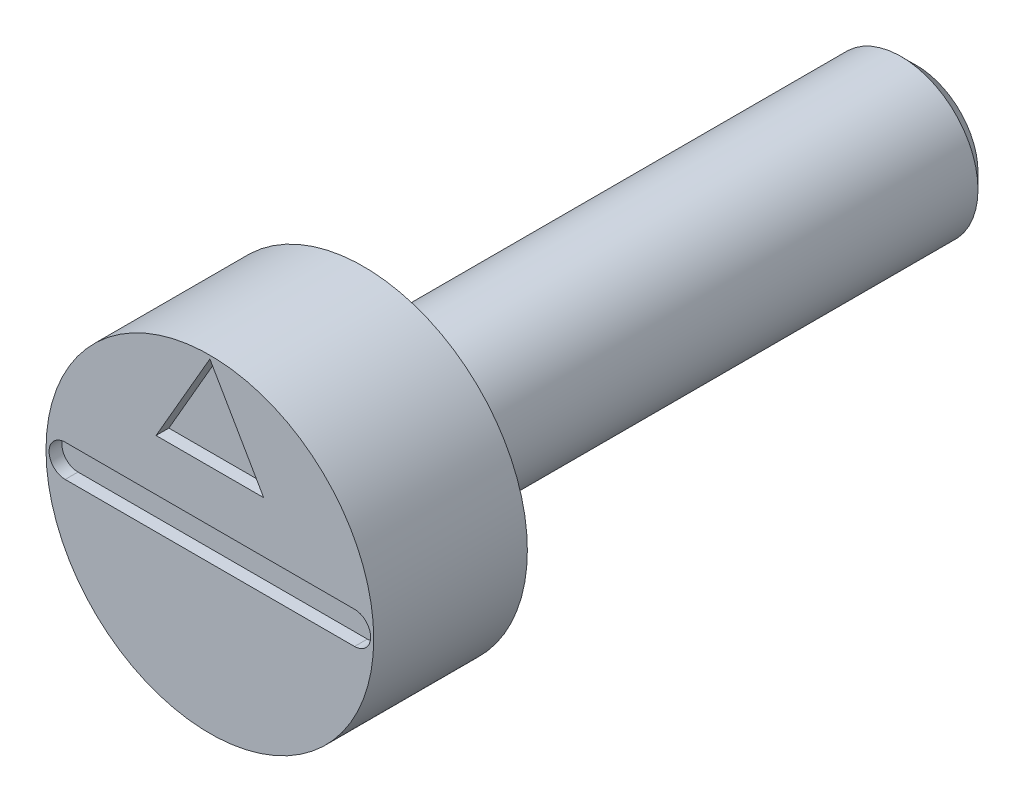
ISO-10303-21;
HEADER;
FILE_DESCRIPTION(('STEP AP214'),'2;1');
FILE_NAME('part.step','',(''),(''),'','','');
FILE_SCHEMA(('AUTOMOTIVE_DESIGN { 1 0 10303 214 1 1 1 1 }'));
ENDSEC;
DATA;
#1=APPLICATION_CONTEXT('core data for automotive mechanical design processes');
#2=APPLICATION_PROTOCOL_DEFINITION('international standard','automotive_design',2000,#1);
#3=PRODUCT_CONTEXT('',#1,'mechanical');
#4=PRODUCT('Part','Part','',(#3));
#5=PRODUCT_RELATED_PRODUCT_CATEGORY('part','',(#4));
#6=PRODUCT_DEFINITION_FORMATION('','',#4);
#7=PRODUCT_DEFINITION_CONTEXT('part definition',#1,'design');
#8=PRODUCT_DEFINITION('design','',#6,#7);
#9=PRODUCT_DEFINITION_SHAPE('','',#8);
#10=(LENGTH_UNIT() NAMED_UNIT(*) SI_UNIT(.MILLI.,.METRE.));
#11=(NAMED_UNIT(*) PLANE_ANGLE_UNIT() SI_UNIT($,.RADIAN.));
#12=(NAMED_UNIT(*) SI_UNIT($,.STERADIAN.) SOLID_ANGLE_UNIT());
#13=UNCERTAINTY_MEASURE_WITH_UNIT(LENGTH_MEASURE(1.E-05),#10,'distance_accuracy_value','');
#14=(GEOMETRIC_REPRESENTATION_CONTEXT(3) GLOBAL_UNCERTAINTY_ASSIGNED_CONTEXT((#13)) GLOBAL_UNIT_ASSIGNED_CONTEXT((#10,
#11,#12)) REPRESENTATION_CONTEXT('',''));
#15=CARTESIAN_POINT('',(0.,0.,0.));
#16=DIRECTION('',(0.,0.,1.));
#17=DIRECTION('',(1.,0.,0.));
#18=AXIS2_PLACEMENT_3D('',#15,#16,#17);
#19=CARTESIAN_POINT('',(1.59999680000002,0.,0.));
#20=DIRECTION('',(0.,0.,1.));
#21=DIRECTION('',(1.,0.,0.));
#22=AXIS2_PLACEMENT_3D('',#19,#20,#21);
#23=PLANE('',#22);
#24=CARTESIAN_POINT('',(-2.825,0.,0.));
#25=DIRECTION('',(0.,0.,1.));
#26=DIRECTION('',(1.,0.,0.));
#27=AXIS2_PLACEMENT_3D('',#24,#25,#26);
#28=CIRCLE('',#27,0.315);
#29=CARTESIAN_POINT('',(-2.825,0.315,0.));
#30=VERTEX_POINT('',#29);
#31=CARTESIAN_POINT('',(-2.825,-0.315,0.));
#32=VERTEX_POINT('',#31);
#33=EDGE_CURVE('E56',#30,#32,#28,.T.);
#34=ORIENTED_EDGE('',*,*,#33,.F.);
#35=DIRECTION('',(-1.,0.,0.));
#36=VECTOR('',#35,1.);
#37=CARTESIAN_POINT('',(-2.825,0.315,0.));
#38=LINE('',#37,#36);
#39=CARTESIAN_POINT('',(2.825,0.315,0.));
#40=VERTEX_POINT('',#39);
#41=EDGE_CURVE('E120',#40,#30,#38,.T.);
#42=ORIENTED_EDGE('',*,*,#41,.F.);
#43=CARTESIAN_POINT('',(2.825,0.,0.));
#44=DIRECTION('',(0.,0.,1.));
#45=DIRECTION('',(1.,0.,0.));
#46=AXIS2_PLACEMENT_3D('',#43,#44,#45);
#47=CIRCLE('',#46,0.315);
#48=CARTESIAN_POINT('',(2.825,-0.315,0.));
#49=VERTEX_POINT('',#48);
#50=EDGE_CURVE('E123',#49,#40,#47,.T.);
#51=ORIENTED_EDGE('',*,*,#50,.F.);
#52=DIRECTION('',(1.,0.,0.));
#53=VECTOR('',#52,1.);
#54=CARTESIAN_POINT('',(-2.825,-0.315,0.));
#55=LINE('',#54,#53);
#56=EDGE_CURVE('E129',#32,#49,#55,.T.);
#57=ORIENTED_EDGE('',*,*,#56,.F.);
#58=EDGE_LOOP('',(#34,#42,#51,#57));
#59=FACE_BOUND('',#58,.T.);
#60=DIRECTION('',(-0.499999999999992,0.866025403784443,0.));
#61=VECTOR('',#60,1.);
#62=CARTESIAN_POINT('',(1.0507774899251,1.315,0.));
#63=LINE('',#62,#61);
#64=CARTESIAN_POINT('',(1.0507774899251,1.315,0.));
#65=VERTEX_POINT('',#64);
#66=CARTESIAN_POINT('',(0.,3.135,0.));
#67=VERTEX_POINT('',#66);
#68=EDGE_CURVE('E64',#65,#67,#63,.T.);
#69=ORIENTED_EDGE('',*,*,#68,.F.);
#70=DIRECTION('',(1.,0.,0.));
#71=VECTOR('',#70,1.);
#72=CARTESIAN_POINT('',(-1.05077748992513,1.315,0.));
#73=LINE('',#72,#71);
#74=CARTESIAN_POINT('',(-1.05077748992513,1.315,0.));
#75=VERTEX_POINT('',#74);
#76=EDGE_CURVE('E142',#75,#65,#73,.T.);
#77=ORIENTED_EDGE('',*,*,#76,.F.);
#78=DIRECTION('',(-0.500000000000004,-0.866025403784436,0.));
#79=VECTOR('',#78,1.);
#80=CARTESIAN_POINT('',(0.,3.135,0.));
#81=LINE('',#80,#79);
#82=EDGE_CURVE('E150',#67,#75,#81,.T.);
#83=ORIENTED_EDGE('',*,*,#82,.F.);
#84=EDGE_LOOP('',(#69,#77,#83));
#85=FACE_BOUND('',#84,.T.);
#86=CARTESIAN_POINT('',(0.,0.,0.));
#87=DIRECTION('',(0.,0.,-1.));
#88=DIRECTION('',(-1.,0.,0.));
#89=AXIS2_PLACEMENT_3D('',#86,#87,#88);
#90=CIRCLE('',#89,3.1999936);
#91=CARTESIAN_POINT('',(-3.1999936,0.,0.));
#92=VERTEX_POINT('',#91);
#93=EDGE_CURVE('E163',#92,#92,#90,.T.);
#94=ORIENTED_EDGE('',*,*,#93,.F.);
#95=EDGE_LOOP('',(#94));
#96=FACE_BOUND('',#95,.T.);
#97=ADVANCED_FACE('F40',(#59,#85,#96),#23,.T.);
#98=CARTESIAN_POINT('',(0.,0.,-1.499997));
#99=DIRECTION('',(0.,0.,-1.));
#100=DIRECTION('',(-1.,0.,0.));
#101=AXIS2_PLACEMENT_3D('',#98,#99,#100);
#102=CYLINDRICAL_SURFACE('',#101,3.1999936);
#103=ORIENTED_EDGE('',*,*,#93,.T.);
#104=EDGE_LOOP('',(#103));
#105=FACE_BOUND('',#104,.T.);
#106=CARTESIAN_POINT('',(0.,0.,-2.999994));
#107=DIRECTION('',(0.,0.,-1.));
#108=DIRECTION('',(-1.,0.,0.));
#109=AXIS2_PLACEMENT_3D('',#106,#107,#108);
#110=CIRCLE('',#109,3.1999936);
#111=CARTESIAN_POINT('',(-3.1999936,0.,-2.999994));
#112=VERTEX_POINT('',#111);
#113=EDGE_CURVE('E164',#112,#112,#110,.T.);
#114=ORIENTED_EDGE('',*,*,#113,.F.);
#115=EDGE_LOOP('',(#114));
#116=FACE_BOUND('',#115,.T.);
#117=ADVANCED_FACE('F183',(#105,#116),#102,.T.);
#118=CARTESIAN_POINT('',(2.47499505,0.,-2.999994));
#119=DIRECTION('',(0.,0.,-1.));
#120=DIRECTION('',(-1.,0.,0.));
#121=AXIS2_PLACEMENT_3D('',#118,#119,#120);
#122=PLANE('',#121);
#123=ORIENTED_EDGE('',*,*,#113,.T.);
#124=EDGE_LOOP('',(#123));
#125=FACE_BOUND('',#124,.T.);
#126=CARTESIAN_POINT('',(-1.02838481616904E-13,0.,-2.99999400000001));
#127=DIRECTION('',(0.,0.,1.));
#128=DIRECTION('',(1.,0.,0.));
#129=AXIS2_PLACEMENT_3D('',#126,#127,#128);
#130=CIRCLE('',#129,1.50000000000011);
#131=CARTESIAN_POINT('',(1.5,0.,-2.999994));
#132=VERTEX_POINT('',#131);
#133=EDGE_CURVE('E157',#132,#132,#130,.T.);
#134=ORIENTED_EDGE('',*,*,#133,.T.);
#135=EDGE_LOOP('',(#134));
#136=FACE_BOUND('',#135,.T.);
#137=ADVANCED_FACE('F180',(#125,#136),#122,.T.);
#138=CARTESIAN_POINT('',(0.,0.,-23.999952));
#139=DIRECTION('',(0.,0.,1.));
#140=DIRECTION('',(1.,0.,0.));
#141=AXIS2_PLACEMENT_3D('',#138,#139,#140);
#142=CYLINDRICAL_SURFACE('',#141,1.50000000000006);
#143=CARTESIAN_POINT('',(0.,0.,-13.5));
#144=DIRECTION('',(0.,0.,1.));
#145=DIRECTION('',(1.,0.,0.));
#146=AXIS2_PLACEMENT_3D('',#143,#144,#145);
#147=CIRCLE('',#146,1.50000000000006);
#148=CARTESIAN_POINT('',(1.5,0.,-13.5));
#149=VERTEX_POINT('',#148);
#150=EDGE_CURVE('E12',#149,#149,#147,.T.);
#151=ORIENTED_EDGE('',*,*,#150,.T.);
#152=EDGE_LOOP('',(#151));
#153=FACE_BOUND('',#152,.T.);
#154=ORIENTED_EDGE('',*,*,#133,.F.);
#155=EDGE_LOOP('',(#154));
#156=FACE_BOUND('',#155,.T.);
#157=ADVANCED_FACE('F182',(#153,#156),#142,.T.);
#158=CARTESIAN_POINT('',(1.0507774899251,1.315,-0.25));
#159=DIRECTION('',(0.866025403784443,0.499999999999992,0.));
#160=DIRECTION('',(-0.499999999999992,0.866025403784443,0.));
#161=AXIS2_PLACEMENT_3D('',#158,#159,#160);
#162=PLANE('',#161);
#163=ORIENTED_EDGE('',*,*,#68,.T.);
#164=DIRECTION('',(0.,0.,1.));
#165=VECTOR('',#164,1.);
#166=CARTESIAN_POINT('',(0.,3.135,-0.25));
#167=LINE('',#166,#165);
#168=CARTESIAN_POINT('',(0.,3.135,-0.25));
#169=VERTEX_POINT('',#168);
#170=EDGE_CURVE('E148',#169,#67,#167,.T.);
#171=ORIENTED_EDGE('',*,*,#170,.F.);
#172=DIRECTION('',(-0.499999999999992,0.866025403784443,0.));
#173=VECTOR('',#172,1.);
#174=CARTESIAN_POINT('',(1.0507774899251,1.315,-0.25));
#175=LINE('',#174,#173);
#176=CARTESIAN_POINT('',(1.0507774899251,1.315,-0.25));
#177=VERTEX_POINT('',#176);
#178=EDGE_CURVE('E138',#177,#169,#175,.T.);
#179=ORIENTED_EDGE('',*,*,#178,.F.);
#180=DIRECTION('',(0.,0.,1.));
#181=VECTOR('',#180,1.);
#182=CARTESIAN_POINT('',(1.0507774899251,1.315,-0.25));
#183=LINE('',#182,#181);
#184=EDGE_CURVE('E155',#177,#65,#183,.T.);
#185=ORIENTED_EDGE('',*,*,#184,.T.);
#186=EDGE_LOOP('',(#163,#171,#179,#185));
#187=FACE_BOUND('',#186,.T.);
#188=ADVANCED_FACE('F190',(#187),#162,.F.);
#189=CARTESIAN_POINT('',(-1.05077748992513,1.315,-0.25));
#190=DIRECTION('',(0.,-1.,0.));
#191=DIRECTION('',(1.,0.,0.));
#192=AXIS2_PLACEMENT_3D('',#189,#190,#191);
#193=PLANE('',#192);
#194=ORIENTED_EDGE('',*,*,#76,.T.);
#195=ORIENTED_EDGE('',*,*,#184,.F.);
#196=DIRECTION('',(1.,0.,0.));
#197=VECTOR('',#196,1.);
#198=CARTESIAN_POINT('',(-1.05077748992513,1.315,-0.25));
#199=LINE('',#198,#197);
#200=CARTESIAN_POINT('',(-1.05077748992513,1.315,-0.25));
#201=VERTEX_POINT('',#200);
#202=EDGE_CURVE('E145',#201,#177,#199,.T.);
#203=ORIENTED_EDGE('',*,*,#202,.F.);
#204=DIRECTION('',(0.,0.,1.));
#205=VECTOR('',#204,1.);
#206=CARTESIAN_POINT('',(-1.05077748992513,1.315,-0.25));
#207=LINE('',#206,#205);
#208=EDGE_CURVE('E158',#201,#75,#207,.T.);
#209=ORIENTED_EDGE('',*,*,#208,.T.);
#210=EDGE_LOOP('',(#194,#195,#203,#209));
#211=FACE_BOUND('',#210,.T.);
#212=ADVANCED_FACE('F217',(#211),#193,.F.);
#213=CARTESIAN_POINT('',(0.,3.135,-0.25));
#214=DIRECTION('',(-0.866025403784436,0.500000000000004,0.));
#215=DIRECTION('',(-0.500000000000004,-0.866025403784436,0.));
#216=AXIS2_PLACEMENT_3D('',#213,#214,#215);
#217=PLANE('',#216);
#218=ORIENTED_EDGE('',*,*,#82,.T.);
#219=ORIENTED_EDGE('',*,*,#208,.F.);
#220=DIRECTION('',(-0.500000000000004,-0.866025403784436,0.));
#221=VECTOR('',#220,1.);
#222=CARTESIAN_POINT('',(0.,3.135,-0.25));
#223=LINE('',#222,#221);
#224=EDGE_CURVE('E141',#169,#201,#223,.T.);
#225=ORIENTED_EDGE('',*,*,#224,.F.);
#226=ORIENTED_EDGE('',*,*,#170,.T.);
#227=EDGE_LOOP('',(#218,#219,#225,#226));
#228=FACE_BOUND('',#227,.T.);
#229=ADVANCED_FACE('F210',(#228),#217,.F.);
#230=CARTESIAN_POINT('',(0.,0.,-0.25));
#231=DIRECTION('',(0.,0.,1.));
#232=DIRECTION('',(1.,0.,0.));
#233=AXIS2_PLACEMENT_3D('',#230,#231,#232);
#234=PLANE('',#233);
#235=ORIENTED_EDGE('',*,*,#178,.T.);
#236=ORIENTED_EDGE('',*,*,#224,.T.);
#237=ORIENTED_EDGE('',*,*,#202,.T.);
#238=EDGE_LOOP('',(#235,#236,#237));
#239=FACE_BOUND('',#238,.T.);
#240=ADVANCED_FACE('F215',(#239),#234,.T.);
#241=CARTESIAN_POINT('',(-2.825,0.,-0.25));
#242=DIRECTION('',(0.,0.,1.));
#243=DIRECTION('',(1.,0.,0.));
#244=AXIS2_PLACEMENT_3D('',#241,#242,#243);
#245=CYLINDRICAL_SURFACE('',#244,0.315);
#246=ORIENTED_EDGE('',*,*,#33,.T.);
#247=DIRECTION('',(0.,0.,1.));
#248=VECTOR('',#247,1.);
#249=CARTESIAN_POINT('',(-2.825,-0.315,-0.25));
#250=LINE('',#249,#248);
#251=CARTESIAN_POINT('',(-2.825,-0.315,-0.25));
#252=VERTEX_POINT('',#251);
#253=EDGE_CURVE('E98',#252,#32,#250,.T.);
#254=ORIENTED_EDGE('',*,*,#253,.F.);
#255=CARTESIAN_POINT('',(-2.825,0.,-0.25));
#256=DIRECTION('',(0.,0.,1.));
#257=DIRECTION('',(1.,0.,0.));
#258=AXIS2_PLACEMENT_3D('',#255,#256,#257);
#259=CIRCLE('',#258,0.315);
#260=CARTESIAN_POINT('',(-2.825,0.315,-0.25));
#261=VERTEX_POINT('',#260);
#262=EDGE_CURVE('E102',#261,#252,#259,.T.);
#263=ORIENTED_EDGE('',*,*,#262,.F.);
#264=DIRECTION('',(0.,0.,1.));
#265=VECTOR('',#264,1.);
#266=CARTESIAN_POINT('',(-2.825,0.315,-0.25));
#267=LINE('',#266,#265);
#268=EDGE_CURVE('E133',#261,#30,#267,.T.);
#269=ORIENTED_EDGE('',*,*,#268,.T.);
#270=EDGE_LOOP('',(#246,#254,#263,#269));
#271=FACE_BOUND('',#270,.T.);
#272=ADVANCED_FACE('F100',(#271),#245,.F.);
#273=CARTESIAN_POINT('',(-2.825,0.315,-0.25));
#274=DIRECTION('',(0.,1.,0.));
#275=DIRECTION('',(-1.,0.,0.));
#276=AXIS2_PLACEMENT_3D('',#273,#274,#275);
#277=PLANE('',#276);
#278=ORIENTED_EDGE('',*,*,#41,.T.);
#279=ORIENTED_EDGE('',*,*,#268,.F.);
#280=DIRECTION('',(-1.,0.,0.));
#281=VECTOR('',#280,1.);
#282=CARTESIAN_POINT('',(-2.825,0.315,-0.25));
#283=LINE('',#282,#281);
#284=CARTESIAN_POINT('',(2.825,0.315,-0.25));
#285=VERTEX_POINT('',#284);
#286=EDGE_CURVE('E108',#285,#261,#283,.T.);
#287=ORIENTED_EDGE('',*,*,#286,.F.);
#288=DIRECTION('',(0.,0.,1.));
#289=VECTOR('',#288,1.);
#290=CARTESIAN_POINT('',(2.825,0.315,-0.25));
#291=LINE('',#290,#289);
#292=EDGE_CURVE('E135',#285,#40,#291,.T.);
#293=ORIENTED_EDGE('',*,*,#292,.T.);
#294=EDGE_LOOP('',(#278,#279,#287,#293));
#295=FACE_BOUND('',#294,.T.);
#296=ADVANCED_FACE('F230',(#295),#277,.F.);
#297=CARTESIAN_POINT('',(2.825,0.,-0.25));
#298=DIRECTION('',(0.,0.,1.));
#299=DIRECTION('',(1.,0.,0.));
#300=AXIS2_PLACEMENT_3D('',#297,#298,#299);
#301=CYLINDRICAL_SURFACE('',#300,0.315);
#302=ORIENTED_EDGE('',*,*,#50,.T.);
#303=ORIENTED_EDGE('',*,*,#292,.F.);
#304=CARTESIAN_POINT('',(2.825,0.,-0.25));
#305=DIRECTION('',(0.,0.,1.));
#306=DIRECTION('',(1.,0.,0.));
#307=AXIS2_PLACEMENT_3D('',#304,#305,#306);
#308=CIRCLE('',#307,0.315);
#309=CARTESIAN_POINT('',(2.825,-0.315,-0.25));
#310=VERTEX_POINT('',#309);
#311=EDGE_CURVE('E116',#310,#285,#308,.T.);
#312=ORIENTED_EDGE('',*,*,#311,.F.);
#313=DIRECTION('',(0.,0.,1.));
#314=VECTOR('',#313,1.);
#315=CARTESIAN_POINT('',(2.825,-0.315,-0.25));
#316=LINE('',#315,#314);
#317=EDGE_CURVE('E107',#310,#49,#316,.T.);
#318=ORIENTED_EDGE('',*,*,#317,.T.);
#319=EDGE_LOOP('',(#302,#303,#312,#318));
#320=FACE_BOUND('',#319,.T.);
#321=ADVANCED_FACE('F233',(#320),#301,.F.);
#322=CARTESIAN_POINT('',(-2.825,-0.315,-0.25));
#323=DIRECTION('',(0.,-1.,0.));
#324=DIRECTION('',(1.,0.,0.));
#325=AXIS2_PLACEMENT_3D('',#322,#323,#324);
#326=PLANE('',#325);
#327=ORIENTED_EDGE('',*,*,#56,.T.);
#328=ORIENTED_EDGE('',*,*,#317,.F.);
#329=DIRECTION('',(1.,0.,0.));
#330=VECTOR('',#329,1.);
#331=CARTESIAN_POINT('',(-2.825,-0.315,-0.25));
#332=LINE('',#331,#330);
#333=EDGE_CURVE('E111',#252,#310,#332,.T.);
#334=ORIENTED_EDGE('',*,*,#333,.F.);
#335=ORIENTED_EDGE('',*,*,#253,.T.);
#336=EDGE_LOOP('',(#327,#328,#334,#335));
#337=FACE_BOUND('',#336,.T.);
#338=ADVANCED_FACE('F112',(#337),#326,.F.);
#339=CARTESIAN_POINT('',(-2.825,0.,-0.25));
#340=DIRECTION('',(0.,0.,1.));
#341=DIRECTION('',(1.,0.,0.));
#342=AXIS2_PLACEMENT_3D('',#339,#340,#341);
#343=PLANE('',#342);
#344=ORIENTED_EDGE('',*,*,#262,.T.);
#345=ORIENTED_EDGE('',*,*,#333,.T.);
#346=ORIENTED_EDGE('',*,*,#311,.T.);
#347=ORIENTED_EDGE('',*,*,#286,.T.);
#348=EDGE_LOOP('',(#344,#345,#346,#347));
#349=FACE_BOUND('',#348,.T.);
#350=ADVANCED_FACE('F118',(#349),#343,.T.);
#351=CARTESIAN_POINT('',(1.59999680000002,0.,-13.8));
#352=DIRECTION('',(0.,0.,1.));
#353=DIRECTION('',(1.,0.,0.));
#354=AXIS2_PLACEMENT_3D('',#351,#352,#353);
#355=PLANE('',#354);
#356=CARTESIAN_POINT('',(0.,0.,-13.8));
#357=DIRECTION('',(0.,0.,1.));
#358=DIRECTION('',(1.,0.,0.));
#359=AXIS2_PLACEMENT_3D('',#356,#357,#358);
#360=CIRCLE('',#359,1.20000000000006);
#361=CARTESIAN_POINT('',(1.2,0.,-13.8));
#362=VERTEX_POINT('',#361);
#363=EDGE_CURVE('E49',#362,#362,#360,.F.);
#364=ORIENTED_EDGE('',*,*,#363,.T.);
#365=EDGE_LOOP('',(#364));
#366=FACE_BOUND('',#365,.T.);
#367=ADVANCED_FACE('F171',(#366),#355,.F.);
#368=CARTESIAN_POINT('',(0.,0.,-13.8));
#369=DIRECTION('',(0.,0.,1.));
#370=DIRECTION('',(1.,0.,0.));
#371=AXIS2_PLACEMENT_3D('',#368,#369,#370);
#372=CONICAL_SURFACE('',#371,1.20000000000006,0.785398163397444);
#373=ORIENTED_EDGE('',*,*,#150,.F.);
#374=EDGE_LOOP('',(#373));
#375=FACE_BOUND('',#374,.T.);
#376=ORIENTED_EDGE('',*,*,#363,.F.);
#377=EDGE_LOOP('',(#376));
#378=FACE_BOUND('',#377,.T.);
#379=ADVANCED_FACE('F43',(#375,#378),#372,.T.);
#380=CLOSED_SHELL('',(#97,#117,#137,#157,#188,#212,#229,#240,#272,#296,#321,#338,#350,#367,#379));
#381=MANIFOLD_SOLID_BREP('B2',#380);
#382=ADVANCED_BREP_SHAPE_REPRESENTATION('',(#18,#381),#14);
#383=SHAPE_DEFINITION_REPRESENTATION(#9,#382);
ENDSEC;
END-ISO-10303-21;
